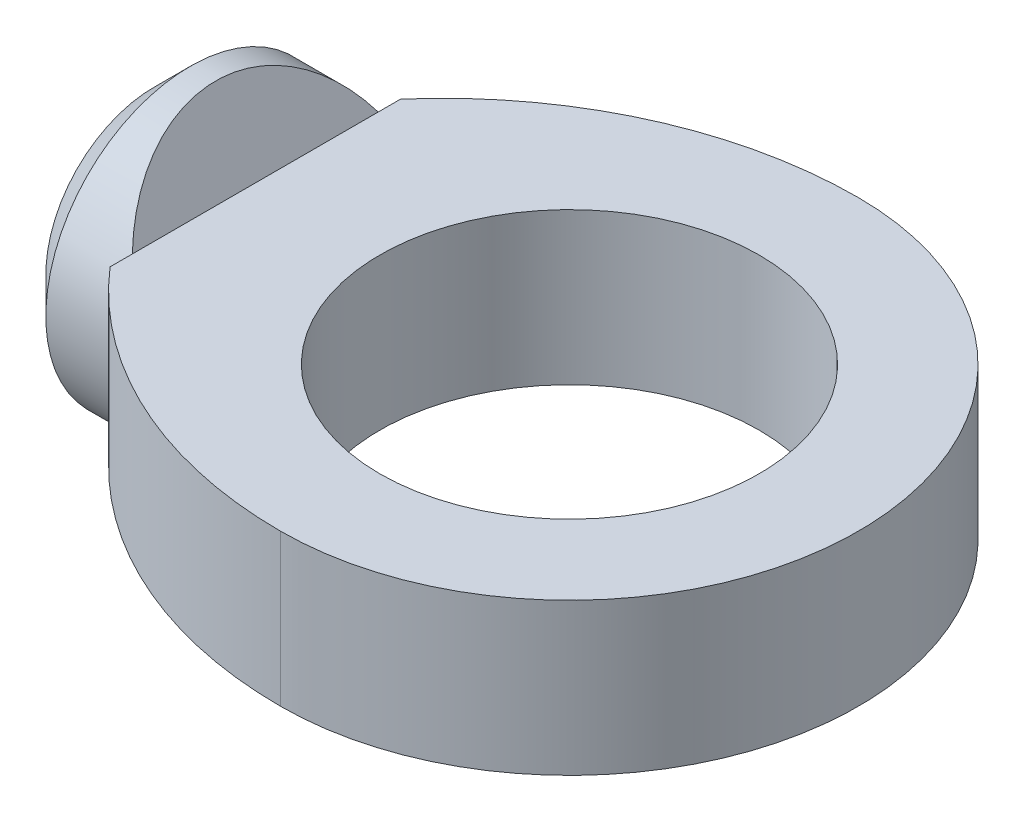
ISO-10303-21;
HEADER;
FILE_DESCRIPTION(('STEP AP214'),'2;1');
FILE_NAME('part.step','',(''),(''),'','','');
FILE_SCHEMA(('AUTOMOTIVE_DESIGN { 1 0 10303 214 1 1 1 1 }'));
ENDSEC;
DATA;
#1=APPLICATION_CONTEXT('core data for automotive mechanical design processes');
#2=APPLICATION_PROTOCOL_DEFINITION('international standard','automotive_design',2000,#1);
#3=PRODUCT_CONTEXT('',#1,'mechanical');
#4=PRODUCT('Part','Part','',(#3));
#5=PRODUCT_RELATED_PRODUCT_CATEGORY('part','',(#4));
#6=PRODUCT_DEFINITION_FORMATION('','',#4);
#7=PRODUCT_DEFINITION_CONTEXT('part definition',#1,'design');
#8=PRODUCT_DEFINITION('design','',#6,#7);
#9=PRODUCT_DEFINITION_SHAPE('','',#8);
#10=(LENGTH_UNIT() NAMED_UNIT(*) SI_UNIT(.MILLI.,.METRE.));
#11=(NAMED_UNIT(*) PLANE_ANGLE_UNIT() SI_UNIT($,.RADIAN.));
#12=(NAMED_UNIT(*) SI_UNIT($,.STERADIAN.) SOLID_ANGLE_UNIT());
#13=UNCERTAINTY_MEASURE_WITH_UNIT(LENGTH_MEASURE(1.E-05),#10,'distance_accuracy_value','');
#14=(GEOMETRIC_REPRESENTATION_CONTEXT(3) GLOBAL_UNCERTAINTY_ASSIGNED_CONTEXT((#13)) GLOBAL_UNIT_ASSIGNED_CONTEXT((#10,
#11,#12)) REPRESENTATION_CONTEXT('',''));
#15=CARTESIAN_POINT('',(0.,0.,0.));
#16=DIRECTION('',(0.,0.,1.));
#17=DIRECTION('',(1.,0.,0.));
#18=AXIS2_PLACEMENT_3D('',#15,#16,#17);
#19=CARTESIAN_POINT('',(-121.,-1.5,0.));
#20=DIRECTION('',(-1.,0.,0.));
#21=DIRECTION('',(0.,0.,1.));
#22=AXIS2_PLACEMENT_3D('',#19,#20,#21);
#23=PLANE('',#22);
#24=CARTESIAN_POINT('',(-121.,0.,0.));
#25=DIRECTION('',(1.,0.,0.));
#26=DIRECTION('',(0.,0.,-1.));
#27=AXIS2_PLACEMENT_3D('',#24,#25,#26);
#28=CIRCLE('',#27,3.);
#29=CARTESIAN_POINT('',(-121.,0.,-3.));
#30=VERTEX_POINT('',#29);
#31=EDGE_CURVE('E20',#30,#30,#28,.T.);
#32=ORIENTED_EDGE('',*,*,#31,.F.);
#33=EDGE_LOOP('',(#32));
#34=FACE_BOUND('',#33,.T.);
#35=ADVANCED_FACE('F16',(#34),#23,.T.);
#36=CARTESIAN_POINT('',(-118.,0.,0.));
#37=DIRECTION('',(1.,0.,0.));
#38=DIRECTION('',(0.,0.,-1.));
#39=AXIS2_PLACEMENT_3D('',#36,#37,#38);
#40=CYLINDRICAL_SURFACE('',#39,3.);
#41=CARTESIAN_POINT('',(-115.,0.,0.));
#42=DIRECTION('',(1.,0.,0.));
#43=DIRECTION('',(0.,0.,-1.));
#44=AXIS2_PLACEMENT_3D('',#41,#42,#43);
#45=CIRCLE('',#44,3.);
#46=CARTESIAN_POINT('',(-115.,0.,-3.));
#47=VERTEX_POINT('',#46);
#48=EDGE_CURVE('E143',#47,#47,#45,.T.);
#49=ORIENTED_EDGE('',*,*,#48,.F.);
#50=EDGE_LOOP('',(#49));
#51=FACE_BOUND('',#50,.T.);
#52=ORIENTED_EDGE('',*,*,#31,.T.);
#53=EDGE_LOOP('',(#52));
#54=FACE_BOUND('',#53,.T.);
#55=ADVANCED_FACE('F150',(#51,#54),#40,.T.);
#56=CARTESIAN_POINT('',(-115.,-16.5,0.));
#57=DIRECTION('',(-1.,0.,0.));
#58=DIRECTION('',(0.,0.,1.));
#59=AXIS2_PLACEMENT_3D('',#56,#57,#58);
#60=PLANE('',#59);
#61=ORIENTED_EDGE('',*,*,#48,.T.);
#62=EDGE_LOOP('',(#61));
#63=FACE_BOUND('',#62,.T.);
#64=CARTESIAN_POINT('',(-115.,0.,0.));
#65=DIRECTION('',(1.,0.,0.));
#66=DIRECTION('',(0.,0.,-1.));
#67=AXIS2_PLACEMENT_3D('',#64,#65,#66);
#68=CIRCLE('',#67,30.);
#69=CARTESIAN_POINT('',(-115.,0.,-30.));
#70=VERTEX_POINT('',#69);
#71=EDGE_CURVE('E128',#70,#70,#68,.T.);
#72=ORIENTED_EDGE('',*,*,#71,.F.);
#73=EDGE_LOOP('',(#72));
#74=FACE_BOUND('',#73,.T.);
#75=ADVANCED_FACE('F158',(#63,#74),#60,.T.);
#76=CARTESIAN_POINT('',(-105.,0.,0.));
#77=DIRECTION('',(1.,0.,0.));
#78=DIRECTION('',(0.,0.,-1.));
#79=AXIS2_PLACEMENT_3D('',#76,#77,#78);
#80=CONICAL_SURFACE('',#79,40.,0.785398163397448);
#81=ORIENTED_EDGE('',*,*,#71,.T.);
#82=EDGE_LOOP('',(#81));
#83=FACE_BOUND('',#82,.T.);
#84=CARTESIAN_POINT('',(-105.,0.,0.));
#85=DIRECTION('',(1.,0.,0.));
#86=DIRECTION('',(0.,0.,-1.));
#87=AXIS2_PLACEMENT_3D('',#84,#85,#86);
#88=CIRCLE('',#87,40.);
#89=CARTESIAN_POINT('',(-105.,0.,-40.));
#90=VERTEX_POINT('',#89);
#91=EDGE_CURVE('E75',#90,#90,#88,.T.);
#92=ORIENTED_EDGE('',*,*,#91,.F.);
#93=EDGE_LOOP('',(#92));
#94=FACE_BOUND('',#93,.T.);
#95=ADVANCED_FACE('F269',(#83,#94),#80,.T.);
#96=CARTESIAN_POINT('',(-107.,55.6410161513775,0.));
#97=DIRECTION('',(0.866025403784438,0.500000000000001,0.));
#98=DIRECTION('',(-0.500000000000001,0.866025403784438,0.));
#99=AXIS2_PLACEMENT_3D('',#96,#97,#98);
#100=PLANE('',#99);
#101=DIRECTION('',(0.,0.,-1.));
#102=VECTOR('',#101,1.);
#103=CARTESIAN_POINT('',(-87.,21.,0.));
#104=LINE('',#103,#102);
#105=CARTESIAN_POINT('',(-87.,21.,34.0440890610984));
#106=VERTEX_POINT('',#105);
#107=CARTESIAN_POINT('',(-87.,21.,-34.0440890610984));
#108=VERTEX_POINT('',#107);
#109=EDGE_CURVE('E66',#106,#108,#104,.T.);
#110=ORIENTED_EDGE('',*,*,#109,.T.);
#111=CARTESIAN_POINT('',(-74.8756443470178,0.,0.));
#112=DIRECTION('',(0.866025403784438,0.500000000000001,0.));
#113=DIRECTION('',(0.500000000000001,-0.866025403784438,0.));
#114=AXIS2_PLACEMENT_3D('',#111,#112,#113);
#115=ELLIPSE('',#114,46.1880215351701,40.);
#116=EDGE_CURVE('E69',#106,#108,#115,.F.);
#117=ORIENTED_EDGE('',*,*,#116,.F.);
#118=EDGE_LOOP('',(#110,#117));
#119=FACE_BOUND('',#118,.T.);
#120=ADVANCED_FACE('F71',(#119),#100,.T.);
#121=CARTESIAN_POINT('',(-52.5,0.,0.));
#122=DIRECTION('',(1.,0.,0.));
#123=DIRECTION('',(0.,0.,-1.));
#124=AXIS2_PLACEMENT_3D('',#121,#122,#123);
#125=CYLINDRICAL_SURFACE('',#124,40.);
#126=ORIENTED_EDGE('',*,*,#91,.T.);
#127=EDGE_LOOP('',(#126));
#128=FACE_BOUND('',#127,.T.);
#129=CARTESIAN_POINT('',(-87.,0.,0.));
#130=DIRECTION('',(1.,0.,0.));
#131=DIRECTION('',(0.,0.,-1.));
#132=AXIS2_PLACEMENT_3D('',#129,#130,#131);
#133=CIRCLE('',#132,40.);
#134=CARTESIAN_POINT('',(-87.,-21.,-34.0440890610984));
#135=VERTEX_POINT('',#134);
#136=EDGE_CURVE('E104',#108,#135,#133,.F.);
#137=ORIENTED_EDGE('',*,*,#136,.T.);
#138=CARTESIAN_POINT('',(-74.8756443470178,0.,0.));
#139=DIRECTION('',(0.866025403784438,-0.500000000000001,0.));
#140=DIRECTION('',(0.500000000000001,0.866025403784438,0.));
#141=AXIS2_PLACEMENT_3D('',#138,#139,#140);
#142=ELLIPSE('',#141,46.1880215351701,40.);
#143=CARTESIAN_POINT('',(-87.,-21.,34.0440890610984));
#144=VERTEX_POINT('',#143);
#145=EDGE_CURVE('E80',#144,#135,#142,.T.);
#146=ORIENTED_EDGE('',*,*,#145,.F.);
#147=CARTESIAN_POINT('',(-87.,0.,0.));
#148=DIRECTION('',(1.,0.,0.));
#149=DIRECTION('',(0.,0.,-1.));
#150=AXIS2_PLACEMENT_3D('',#147,#148,#149);
#151=CIRCLE('',#150,40.);
#152=EDGE_CURVE('E78',#144,#106,#151,.F.);
#153=ORIENTED_EDGE('',*,*,#152,.T.);
#154=ORIENTED_EDGE('',*,*,#116,.T.);
#155=EDGE_LOOP('',(#137,#146,#153,#154));
#156=FACE_BOUND('',#155,.T.);
#157=ADVANCED_FACE('F79',(#128,#156),#125,.T.);
#158=CARTESIAN_POINT('',(28.0567261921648,21.,0.));
#159=DIRECTION('',(0.,-1.,0.));
#160=DIRECTION('',(0.,0.,-1.));
#161=AXIS2_PLACEMENT_3D('',#158,#159,#160);
#162=PLANE('',#161);
#163=CARTESIAN_POINT('',(1.00030206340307E-10,21.,-35.0000000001));
#164=DIRECTION('',(0.,1.,0.));
#165=DIRECTION('',(0.,0.,1.));
#166=AXIS2_PLACEMENT_3D('',#163,#164,#165);
#167=CIRCLE('',#166,115.);
#168=CARTESIAN_POINT('',(-6.43051326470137E-11,21.,79.99999999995));
#169=VERTEX_POINT('',#168);
#170=CARTESIAN_POINT('',(-87.,21.,40.206382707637));
#171=VERTEX_POINT('',#170);
#172=EDGE_CURVE('E117',#169,#171,#167,.F.);
#173=ORIENTED_EDGE('',*,*,#172,.F.);
#174=CARTESIAN_POINT('',(0.,21.,0.));
#175=DIRECTION('',(0.,-1.,0.));
#176=DIRECTION('',(0.,0.,-1.));
#177=AXIS2_PLACEMENT_3D('',#174,#175,#176);
#178=CIRCLE('',#177,80.);
#179=CARTESIAN_POINT('',(-1.14320235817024E-10,21.,-79.99999999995));
#180=VERTEX_POINT('',#179);
#181=EDGE_CURVE('E115',#180,#169,#178,.T.);
#182=ORIENTED_EDGE('',*,*,#181,.F.);
#183=CARTESIAN_POINT('',(1.00030206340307E-10,21.,35.0000000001));
#184=DIRECTION('',(0.,-1.,0.));
#185=DIRECTION('',(0.,0.,-1.));
#186=AXIS2_PLACEMENT_3D('',#183,#184,#185);
#187=CIRCLE('',#186,115.);
#188=CARTESIAN_POINT('',(-87.,21.,-40.206382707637));
#189=VERTEX_POINT('',#188);
#190=EDGE_CURVE('E121',#189,#180,#187,.T.);
#191=ORIENTED_EDGE('',*,*,#190,.F.);
#192=DIRECTION('',(0.,0.,-1.));
#193=VECTOR('',#192,1.);
#194=CARTESIAN_POINT('',(-87.,21.,0.));
#195=LINE('',#194,#193);
#196=EDGE_CURVE('E94',#189,#108,#195,.F.);
#197=ORIENTED_EDGE('',*,*,#196,.T.);
#198=ORIENTED_EDGE('',*,*,#109,.F.);
#199=DIRECTION('',(0.,0.,-1.));
#200=VECTOR('',#199,1.);
#201=CARTESIAN_POINT('',(-87.,21.,0.));
#202=LINE('',#201,#200);
#203=EDGE_CURVE('E85',#106,#171,#202,.F.);
#204=ORIENTED_EDGE('',*,*,#203,.T.);
#205=EDGE_LOOP('',(#173,#182,#191,#197,#198,#204));
#206=FACE_BOUND('',#205,.T.);
#207=CARTESIAN_POINT('',(0.,21.,0.));
#208=DIRECTION('',(0.,-1.,0.));
#209=DIRECTION('',(0.,0.,-1.));
#210=AXIS2_PLACEMENT_3D('',#207,#208,#209);
#211=CIRCLE('',#210,52.5);
#212=CARTESIAN_POINT('',(0.,21.,-52.5));
#213=VERTEX_POINT('',#212);
#214=EDGE_CURVE('E86',#213,#213,#211,.T.);
#215=ORIENTED_EDGE('',*,*,#214,.T.);
#216=EDGE_LOOP('',(#215));
#217=FACE_BOUND('',#216,.T.);
#218=ADVANCED_FACE('F90',(#206,#217),#162,.F.);
#219=CARTESIAN_POINT('',(0.,0.,0.));
#220=DIRECTION('',(0.,-1.,0.));
#221=DIRECTION('',(0.,0.,-1.));
#222=AXIS2_PLACEMENT_3D('',#219,#220,#221);
#223=CYLINDRICAL_SURFACE('',#222,52.5);
#224=CARTESIAN_POINT('',(0.,-21.,0.));
#225=DIRECTION('',(0.,-1.,0.));
#226=DIRECTION('',(0.,0.,-1.));
#227=AXIS2_PLACEMENT_3D('',#224,#225,#226);
#228=CIRCLE('',#227,52.5);
#229=CARTESIAN_POINT('',(0.,-21.,-52.5));
#230=VERTEX_POINT('',#229);
#231=EDGE_CURVE('E113',#230,#230,#228,.F.);
#232=ORIENTED_EDGE('',*,*,#231,.F.);
#233=EDGE_LOOP('',(#232));
#234=FACE_BOUND('',#233,.T.);
#235=ORIENTED_EDGE('',*,*,#214,.F.);
#236=EDGE_LOOP('',(#235));
#237=FACE_BOUND('',#236,.T.);
#238=ADVANCED_FACE('F172',(#234,#237),#223,.F.);
#239=CARTESIAN_POINT('',(-87.,-45.,0.));
#240=DIRECTION('',(1.,0.,0.));
#241=DIRECTION('',(0.,0.,-1.));
#242=AXIS2_PLACEMENT_3D('',#239,#240,#241);
#243=PLANE('',#242);
#244=DIRECTION('',(0.,1.,0.));
#245=VECTOR('',#244,1.);
#246=CARTESIAN_POINT('',(-87.,-21.,40.206382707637));
#247=LINE('',#246,#245);
#248=CARTESIAN_POINT('',(-87.,-21.,40.206382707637));
#249=VERTEX_POINT('',#248);
#250=EDGE_CURVE('E98',#171,#249,#247,.F.);
#251=ORIENTED_EDGE('',*,*,#250,.F.);
#252=ORIENTED_EDGE('',*,*,#203,.F.);
#253=ORIENTED_EDGE('',*,*,#152,.F.);
#254=DIRECTION('',(0.,0.,-1.));
#255=VECTOR('',#254,1.);
#256=CARTESIAN_POINT('',(-87.,-21.,0.));
#257=LINE('',#256,#255);
#258=EDGE_CURVE('E110',#249,#144,#257,.T.);
#259=ORIENTED_EDGE('',*,*,#258,.F.);
#260=EDGE_LOOP('',(#251,#252,#253,#259));
#261=FACE_BOUND('',#260,.T.);
#262=ADVANCED_FACE('F96',(#261),#243,.F.);
#263=CARTESIAN_POINT('',(-107.,-55.6410161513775,0.));
#264=DIRECTION('',(0.866025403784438,-0.500000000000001,0.));
#265=DIRECTION('',(0.500000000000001,0.866025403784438,0.));
#266=AXIS2_PLACEMENT_3D('',#263,#264,#265);
#267=PLANE('',#266);
#268=DIRECTION('',(0.,0.,-1.));
#269=VECTOR('',#268,1.);
#270=CARTESIAN_POINT('',(-87.,-21.,0.));
#271=LINE('',#270,#269);
#272=EDGE_CURVE('E109',#144,#135,#271,.T.);
#273=ORIENTED_EDGE('',*,*,#272,.F.);
#274=ORIENTED_EDGE('',*,*,#145,.T.);
#275=EDGE_LOOP('',(#273,#274));
#276=FACE_BOUND('',#275,.T.);
#277=ADVANCED_FACE('F188',(#276),#267,.T.);
#278=CARTESIAN_POINT('',(-87.,-45.,0.));
#279=DIRECTION('',(1.,0.,0.));
#280=DIRECTION('',(0.,0.,-1.));
#281=AXIS2_PLACEMENT_3D('',#278,#279,#280);
#282=PLANE('',#281);
#283=ORIENTED_EDGE('',*,*,#136,.F.);
#284=ORIENTED_EDGE('',*,*,#196,.F.);
#285=DIRECTION('',(0.,-1.,0.));
#286=VECTOR('',#285,1.);
#287=CARTESIAN_POINT('',(-87.,21.,-40.206382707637));
#288=LINE('',#287,#286);
#289=CARTESIAN_POINT('',(-87.,-21.,-40.206382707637));
#290=VERTEX_POINT('',#289);
#291=EDGE_CURVE('E122',#290,#189,#288,.F.);
#292=ORIENTED_EDGE('',*,*,#291,.F.);
#293=DIRECTION('',(0.,0.,-1.));
#294=VECTOR('',#293,1.);
#295=CARTESIAN_POINT('',(-87.,-21.,0.));
#296=LINE('',#295,#294);
#297=EDGE_CURVE('E105',#135,#290,#296,.T.);
#298=ORIENTED_EDGE('',*,*,#297,.F.);
#299=EDGE_LOOP('',(#283,#284,#292,#298));
#300=FACE_BOUND('',#299,.T.);
#301=ADVANCED_FACE('F191',(#300),#282,.F.);
#302=CARTESIAN_POINT('',(1.00030206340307E-10,21.,35.0000000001));
#303=DIRECTION('',(0.,-1.,0.));
#304=DIRECTION('',(0.,0.,-1.));
#305=AXIS2_PLACEMENT_3D('',#302,#303,#304);
#306=CYLINDRICAL_SURFACE('',#305,115.);
#307=DIRECTION('',(0.,-1.,0.));
#308=VECTOR('',#307,1.);
#309=CARTESIAN_POINT('',(0.,21.,-80.));
#310=LINE('',#309,#308);
#311=CARTESIAN_POINT('',(-1.14320235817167E-10,-21.,-80.));
#312=VERTEX_POINT('',#311);
#313=EDGE_CURVE('E118',#312,#180,#310,.F.);
#314=ORIENTED_EDGE('',*,*,#313,.F.);
#315=CARTESIAN_POINT('',(1.00030206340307E-10,-21.,35.0000000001));
#316=DIRECTION('',(0.,-1.,0.));
#317=DIRECTION('',(0.,0.,-1.));
#318=AXIS2_PLACEMENT_3D('',#315,#316,#317);
#319=CIRCLE('',#318,115.);
#320=EDGE_CURVE('E108',#290,#312,#319,.T.);
#321=ORIENTED_EDGE('',*,*,#320,.F.);
#322=ORIENTED_EDGE('',*,*,#291,.T.);
#323=ORIENTED_EDGE('',*,*,#190,.T.);
#324=EDGE_LOOP('',(#314,#321,#322,#323));
#325=FACE_BOUND('',#324,.T.);
#326=ADVANCED_FACE('F195',(#325),#306,.T.);
#327=CARTESIAN_POINT('',(0.,21.,0.));
#328=DIRECTION('',(0.,-1.,0.));
#329=DIRECTION('',(0.,0.,-1.));
#330=AXIS2_PLACEMENT_3D('',#327,#328,#329);
#331=CYLINDRICAL_SURFACE('',#330,80.);
#332=ORIENTED_EDGE('',*,*,#181,.T.);
#333=DIRECTION('',(0.,1.,0.));
#334=VECTOR('',#333,1.);
#335=CARTESIAN_POINT('',(1.00030206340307E-10,-21.,79.9999999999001));
#336=LINE('',#335,#334);
#337=CARTESIAN_POINT('',(-6.43051326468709E-11,-21.,79.9999999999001));
#338=VERTEX_POINT('',#337);
#339=EDGE_CURVE('E35',#338,#169,#336,.T.);
#340=ORIENTED_EDGE('',*,*,#339,.F.);
#341=CARTESIAN_POINT('',(0.,-21.,0.));
#342=DIRECTION('',(0.,-1.,0.));
#343=DIRECTION('',(0.,0.,-1.));
#344=AXIS2_PLACEMENT_3D('',#341,#342,#343);
#345=CIRCLE('',#344,80.);
#346=EDGE_CURVE('E26',#312,#338,#345,.T.);
#347=ORIENTED_EDGE('',*,*,#346,.F.);
#348=ORIENTED_EDGE('',*,*,#313,.T.);
#349=EDGE_LOOP('',(#332,#340,#347,#348));
#350=FACE_BOUND('',#349,.T.);
#351=ADVANCED_FACE('F167',(#350),#331,.T.);
#352=CARTESIAN_POINT('',(1.00030206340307E-10,-21.,-35.0000000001));
#353=DIRECTION('',(0.,1.,0.));
#354=DIRECTION('',(0.,0.,1.));
#355=AXIS2_PLACEMENT_3D('',#352,#353,#354);
#356=CYLINDRICAL_SURFACE('',#355,115.);
#357=ORIENTED_EDGE('',*,*,#339,.T.);
#358=ORIENTED_EDGE('',*,*,#172,.T.);
#359=ORIENTED_EDGE('',*,*,#250,.T.);
#360=CARTESIAN_POINT('',(1.00030206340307E-10,-21.,-35.0000000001));
#361=DIRECTION('',(0.,1.,0.));
#362=DIRECTION('',(0.,0.,1.));
#363=AXIS2_PLACEMENT_3D('',#360,#361,#362);
#364=CIRCLE('',#363,115.);
#365=EDGE_CURVE('E11',#338,#249,#364,.F.);
#366=ORIENTED_EDGE('',*,*,#365,.F.);
#367=EDGE_LOOP('',(#357,#358,#359,#366));
#368=FACE_BOUND('',#367,.T.);
#369=ADVANCED_FACE('F162',(#368),#356,.T.);
#370=CARTESIAN_POINT('',(28.0567261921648,-21.,0.));
#371=DIRECTION('',(0.,-1.,0.));
#372=DIRECTION('',(0.,0.,-1.));
#373=AXIS2_PLACEMENT_3D('',#370,#371,#372);
#374=PLANE('',#373);
#375=ORIENTED_EDGE('',*,*,#346,.T.);
#376=ORIENTED_EDGE('',*,*,#365,.T.);
#377=ORIENTED_EDGE('',*,*,#258,.T.);
#378=ORIENTED_EDGE('',*,*,#272,.T.);
#379=ORIENTED_EDGE('',*,*,#297,.T.);
#380=ORIENTED_EDGE('',*,*,#320,.T.);
#381=EDGE_LOOP('',(#375,#376,#377,#378,#379,#380));
#382=FACE_BOUND('',#381,.T.);
#383=ORIENTED_EDGE('',*,*,#231,.T.);
#384=EDGE_LOOP('',(#383));
#385=FACE_BOUND('',#384,.T.);
#386=ADVANCED_FACE('F18',(#382,#385),#374,.T.);
#387=CLOSED_SHELL('',(#35,#55,#75,#95,#120,#157,#218,#238,#262,#277,#301,#326,#351,#369,#386));
#388=MANIFOLD_SOLID_BREP('B1',#387);
#389=ADVANCED_BREP_SHAPE_REPRESENTATION('',(#18,#388),#14);
#390=SHAPE_DEFINITION_REPRESENTATION(#9,#389);
ENDSEC;
END-ISO-10303-21;
